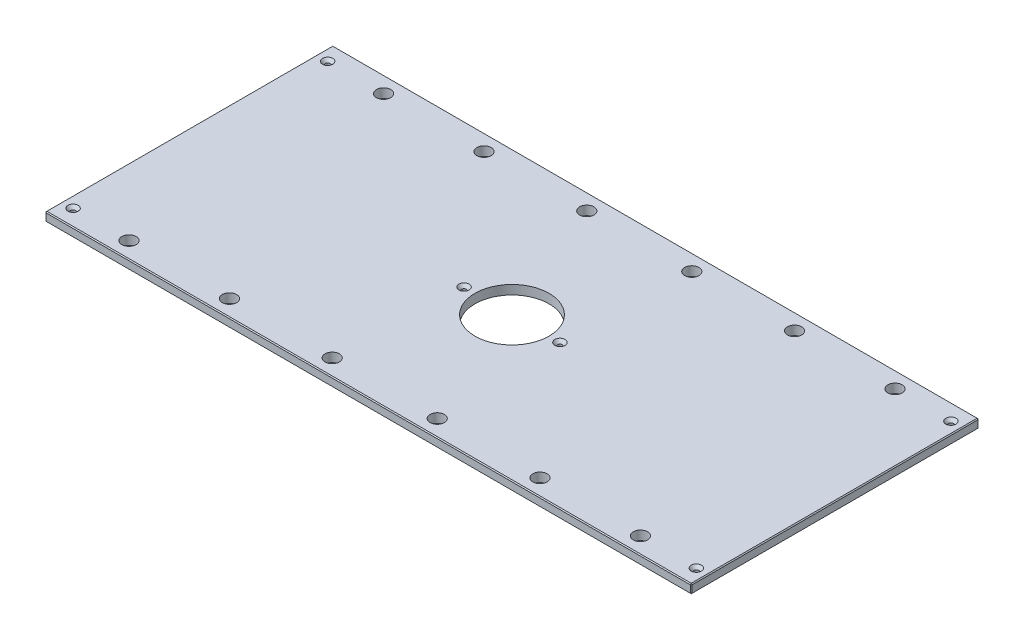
from build123d import *

# Parameters (mm, degrees)
SKETCH1_W                                        = 898.525
SKETCH1_H                                        = 400.05
BOSS_EXTRUDE1_DEPTH                              = 12.7
SKETCH13_R                                       = 51.562
CUT_EXTRUDE6_DEPTH                               = 492.943172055
F_25_32_0_78125_DIAMETER_HOLE1_D                 = 19.84375
CHAMFER2_SIZE                                    = 1.27
CSK_FOR_1_4_FLAT_HEAD_MACHINE_SCREW1_D           = 6.7564
CSK_FOR_1_4_FLAT_HEAD_MACHINE_SCREW1_CSINK_D     = 14.2748
CSK_FOR_1_4_FLAT_HEAD_MACHINE_SCREW1_CSINK_ANGLE = 82


with BuildPart() as part:
    # Sketch1 → Boss-Extrude1 (new body)
    with BuildSketch(Plane(origin=(0, 0, 0), x_dir=(1, 0, 0), z_dir=(0, 1, 0))):
        Rectangle(SKETCH1_W, SKETCH1_H)
    extrude(amount=BOSS_EXTRUDE1_DEPTH)

    # Sketch13 → Cut-Extrude6 (cut, through all)
    with BuildSketch(Plane(origin=(0, 12.7, 0), x_dir=(1, 0, 0), z_dir=(0, 1, 0))):
        with Locations(Location((0, 0, 0), (0, 0, 270))):
            Circle(SKETCH13_R)
    extrude(amount=-CUT_EXTRUDE6_DEPTH, mode=Mode.SUBTRACT)

    # 25_32 _0.78125_ Diameter Hole1 (through all)
    with Locations(Plane(origin=(0, 12.7, 0), x_dir=(1, 0, 0), z_dir=(0, 1, 0))):
        with Locations((355.6, 177.00498), (-355.6, 177.00498), (355.6, -177.00498), (-355.6, -177.00498), (-215.9, 177.00498), (215.9, 177.00498), (215.9, -177.00498), (-215.9, -177.00498), (73.025, 177.00498), (-73.025, 177.00498), (-73.025, -177.00498), (73.025, -177.00498)):
            Hole(F_25_32_0_78125_DIAMETER_HOLE1_D / 2)

    # Chamfer2
    chamfer2_edges = [part.edges().sort_by_distance(p)[0] for p in [
        (449.2625, 12.7, 0),
        (0, 12.7, -200.025),
        (-449.2625, 12.7, 0),
        (0, 0, -200.025),
        (449.2625, 0, 0),
        (0, 0, 200.025),
        (-449.2625, 0, 0),
        (0, 12.7, 200.025),
        (-449.2625, 6.35, -200.025),
        (449.2625, 6.35, -200.025),
        (449.2625, 6.35, 200.025),
        (-449.2625, 6.35, 200.025),
    ]]
    chamfer(chamfer2_edges, length=CHAMFER2_SIZE)

    # CSK for 1_4 Flat Head Machine Screw1 (through all)
    with Locations(Plane(origin=(0, 12.7, 0), x_dir=(1, 0, 0), z_dir=(0, 1, 0))):
        with Locations((433.3875, 177.00498), (433.3875, -177.00498), (-433.3875, -177.00498), (-66.675, 0), (66.675, 0), (-433.3875, 177.00498), (-355.6, 177.00498), (-355.6, -177.00498)):
            CounterSinkHole(CSK_FOR_1_4_FLAT_HEAD_MACHINE_SCREW1_D / 2, CSK_FOR_1_4_FLAT_HEAD_MACHINE_SCREW1_CSINK_D / 2, counter_sink_angle=CSK_FOR_1_4_FLAT_HEAD_MACHINE_SCREW1_CSINK_ANGLE)


solid = part.part
